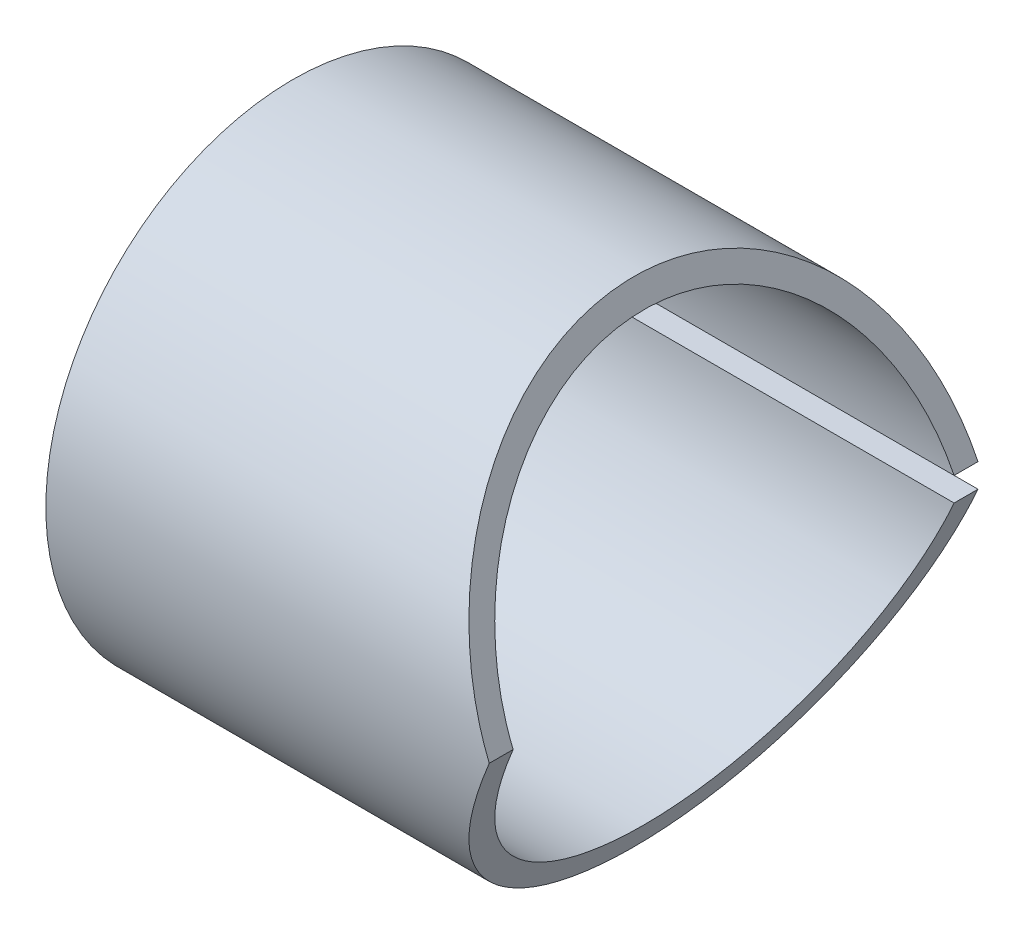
ISO-10303-21;
HEADER;
FILE_DESCRIPTION(('STEP AP214'),'2;1');
FILE_NAME('part.step','',(''),(''),'','','');
FILE_SCHEMA(('AUTOMOTIVE_DESIGN { 1 0 10303 214 1 1 1 1 }'));
ENDSEC;
DATA;
#1=APPLICATION_CONTEXT('core data for automotive mechanical design processes');
#2=APPLICATION_PROTOCOL_DEFINITION('international standard','automotive_design',2000,#1);
#3=PRODUCT_CONTEXT('',#1,'mechanical');
#4=PRODUCT('Part','Part','',(#3));
#5=PRODUCT_RELATED_PRODUCT_CATEGORY('part','',(#4));
#6=PRODUCT_DEFINITION_FORMATION('','',#4);
#7=PRODUCT_DEFINITION_CONTEXT('part definition',#1,'design');
#8=PRODUCT_DEFINITION('design','',#6,#7);
#9=PRODUCT_DEFINITION_SHAPE('','',#8);
#10=(LENGTH_UNIT() NAMED_UNIT(*) SI_UNIT(.MILLI.,.METRE.));
#11=(NAMED_UNIT(*) PLANE_ANGLE_UNIT() SI_UNIT($,.RADIAN.));
#12=(NAMED_UNIT(*) SI_UNIT($,.STERADIAN.) SOLID_ANGLE_UNIT());
#13=UNCERTAINTY_MEASURE_WITH_UNIT(LENGTH_MEASURE(1.E-05),#10,'distance_accuracy_value','');
#14=(GEOMETRIC_REPRESENTATION_CONTEXT(3) GLOBAL_UNCERTAINTY_ASSIGNED_CONTEXT((#13)) GLOBAL_UNIT_ASSIGNED_CONTEXT((#10,
#11,#12)) REPRESENTATION_CONTEXT('',''));
#15=CARTESIAN_POINT('',(0.,0.,0.));
#16=DIRECTION('',(0.,0.,1.));
#17=DIRECTION('',(1.,0.,0.));
#18=AXIS2_PLACEMENT_3D('',#15,#16,#17);
#19=CARTESIAN_POINT('',(-36.3119482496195,3.80347689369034E-13,0.));
#20=DIRECTION('',(1.,0.,0.));
#21=DIRECTION('',(0.,0.,-1.));
#22=AXIS2_PLACEMENT_3D('',#19,#20,#21);
#23=CYLINDRICAL_SURFACE('',#22,10.3513698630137);
#24=CARTESIAN_POINT('',(-17.7282787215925,1.8569397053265E-13,0.));
#25=DIRECTION('',(0.923879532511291,0.382683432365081,0.));
#26=DIRECTION('',(0.382683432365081,-0.923879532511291,0.));
#27=AXIS2_PLACEMENT_3D('',#24,#25,#26);
#28=ELLIPSE('',#27,11.2042420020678,10.3513698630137);
#29=CARTESIAN_POINT('',(-17.9353855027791,0.500000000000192,-10.3392871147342));
#30=VERTEX_POINT('',#29);
#31=CARTESIAN_POINT('',(-17.7282787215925,1.81701733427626E-13,10.3513698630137));
#32=VERTEX_POINT('',#31);
#33=EDGE_CURVE('E89',#30,#32,#28,.T.);
#34=ORIENTED_EDGE('',*,*,#33,.F.);
#35=DIRECTION('',(1.,0.,0.));
#36=VECTOR('',#35,1.);
#37=CARTESIAN_POINT('',(-36.3119482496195,0.500000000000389,-10.3392871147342));
#38=LINE('',#37,#36);
#39=CARTESIAN_POINT('',(-36.3119482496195,0.500000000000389,-10.3392871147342));
#40=VERTEX_POINT('',#39);
#41=EDGE_CURVE('E51',#30,#40,#38,.F.);
#42=ORIENTED_EDGE('',*,*,#41,.T.);
#43=CARTESIAN_POINT('',(-36.3119482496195,3.80347689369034E-13,0.));
#44=DIRECTION('',(-1.,0.,0.));
#45=DIRECTION('',(0.,0.,1.));
#46=AXIS2_PLACEMENT_3D('',#43,#44,#45);
#47=CIRCLE('',#46,10.3513698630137);
#48=CARTESIAN_POINT('',(-36.3119482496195,-0.499999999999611,-10.3392871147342));
#49=VERTEX_POINT('',#48);
#50=EDGE_CURVE('E87',#49,#40,#47,.T.);
#51=ORIENTED_EDGE('',*,*,#50,.F.);
#52=DIRECTION('',(1.,0.,0.));
#53=VECTOR('',#52,1.);
#54=CARTESIAN_POINT('',(-36.3119482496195,-0.499999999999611,-10.3392871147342));
#55=LINE('',#54,#53);
#56=CARTESIAN_POINT('',(-17.9353855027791,-0.499999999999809,-10.3392871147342));
#57=VERTEX_POINT('',#56);
#58=EDGE_CURVE('E115',#57,#49,#55,.F.);
#59=ORIENTED_EDGE('',*,*,#58,.F.);
#60=CARTESIAN_POINT('',(-17.7282787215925,1.8569397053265E-13,0.));
#61=DIRECTION('',(0.923879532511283,-0.3826834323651,0.));
#62=DIRECTION('',(0.3826834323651,0.923879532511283,0.));
#63=AXIS2_PLACEMENT_3D('',#60,#61,#62);
#64=ELLIPSE('',#63,11.2042420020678,10.3513698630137);
#65=EDGE_CURVE('E98',#32,#57,#64,.T.);
#66=ORIENTED_EDGE('',*,*,#65,.F.);
#67=EDGE_LOOP('',(#34,#42,#51,#59,#66));
#68=FACE_BOUND('',#67,.T.);
#69=ADVANCED_FACE('F30',(#68),#23,.T.);
#70=CARTESIAN_POINT('',(-22.0159565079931,-10.3513698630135,-10.3513698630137));
#71=DIRECTION('',(0.923879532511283,-0.3826834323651,0.));
#72=DIRECTION('',(0.3826834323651,0.923879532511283,0.));
#73=AXIS2_PLACEMENT_3D('',#70,#71,#72);
#74=PLANE('',#73);
#75=ORIENTED_EDGE('',*,*,#65,.T.);
#76=DIRECTION('',(0.,0.,1.));
#77=VECTOR('',#76,1.);
#78=CARTESIAN_POINT('',(-17.9353855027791,-0.499999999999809,-10.3513698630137));
#79=LINE('',#78,#77);
#80=CARTESIAN_POINT('',(-17.9353855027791,-0.499999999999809,-9.33799327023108));
#81=VERTEX_POINT('',#80);
#82=EDGE_CURVE('E11',#57,#81,#79,.T.);
#83=ORIENTED_EDGE('',*,*,#82,.T.);
#84=CARTESIAN_POINT('',(-17.7282787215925,1.8569397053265E-13,0.));
#85=DIRECTION('',(0.923879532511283,-0.3826834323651,0.));
#86=DIRECTION('',(0.3826834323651,0.923879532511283,0.));
#87=AXIS2_PLACEMENT_3D('',#84,#85,#86);
#88=ELLIPSE('',#87,10.1218498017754,9.3513698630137);
#89=CARTESIAN_POINT('',(-17.7282787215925,1.81701733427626E-13,9.35136986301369));
#90=VERTEX_POINT('',#89);
#91=EDGE_CURVE('E96',#90,#81,#88,.T.);
#92=ORIENTED_EDGE('',*,*,#91,.F.);
#93=DIRECTION('',(0.,0.,1.));
#94=VECTOR('',#93,1.);
#95=CARTESIAN_POINT('',(-17.7282787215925,1.81701733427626E-13,-10.3513698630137));
#96=LINE('',#95,#94);
#97=EDGE_CURVE('E111',#90,#32,#96,.T.);
#98=ORIENTED_EDGE('',*,*,#97,.T.);
#99=EDGE_LOOP('',(#75,#83,#92,#98));
#100=FACE_BOUND('',#99,.T.);
#101=ADVANCED_FACE('F117',(#100),#74,.T.);
#102=CARTESIAN_POINT('',(-36.3119482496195,3.80347689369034E-13,0.));
#103=DIRECTION('',(1.,0.,0.));
#104=DIRECTION('',(0.,0.,-1.));
#105=AXIS2_PLACEMENT_3D('',#102,#103,#104);
#106=CYLINDRICAL_SURFACE('',#105,9.3513698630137);
#107=DIRECTION('',(1.,0.,0.));
#108=VECTOR('',#107,1.);
#109=CARTESIAN_POINT('',(-36.3119482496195,0.500000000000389,-9.33799327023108));
#110=LINE('',#109,#108);
#111=CARTESIAN_POINT('',(-17.9353855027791,0.500000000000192,-9.33799327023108));
#112=VERTEX_POINT('',#111);
#113=CARTESIAN_POINT('',(-36.3119482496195,0.500000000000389,-9.33799327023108));
#114=VERTEX_POINT('',#113);
#115=EDGE_CURVE('E76',#112,#114,#110,.F.);
#116=ORIENTED_EDGE('',*,*,#115,.F.);
#117=CARTESIAN_POINT('',(-17.7282787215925,1.8569397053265E-13,0.));
#118=DIRECTION('',(0.923879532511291,0.382683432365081,0.));
#119=DIRECTION('',(0.382683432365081,-0.923879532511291,0.));
#120=AXIS2_PLACEMENT_3D('',#117,#118,#119);
#121=ELLIPSE('',#120,10.1218498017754,9.3513698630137);
#122=EDGE_CURVE('E93',#112,#90,#121,.T.);
#123=ORIENTED_EDGE('',*,*,#122,.T.);
#124=ORIENTED_EDGE('',*,*,#91,.T.);
#125=DIRECTION('',(1.,0.,0.));
#126=VECTOR('',#125,1.);
#127=CARTESIAN_POINT('',(-36.3119482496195,-0.499999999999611,-9.33799327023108));
#128=LINE('',#127,#126);
#129=CARTESIAN_POINT('',(-36.3119482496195,-0.499999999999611,-9.33799327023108));
#130=VERTEX_POINT('',#129);
#131=EDGE_CURVE('E44',#81,#130,#128,.F.);
#132=ORIENTED_EDGE('',*,*,#131,.T.);
#133=CARTESIAN_POINT('',(-36.3119482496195,3.80347689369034E-13,0.));
#134=DIRECTION('',(-1.,0.,0.));
#135=DIRECTION('',(0.,1.,0.));
#136=AXIS2_PLACEMENT_3D('',#133,#134,#135);
#137=CIRCLE('',#136,9.3513698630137);
#138=EDGE_CURVE('E94',#130,#114,#137,.T.);
#139=ORIENTED_EDGE('',*,*,#138,.T.);
#140=EDGE_LOOP('',(#116,#123,#124,#132,#139));
#141=FACE_BOUND('',#140,.T.);
#142=ADVANCED_FACE('F106',(#141),#106,.F.);
#143=CARTESIAN_POINT('',(-36.3119482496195,3.80347689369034E-13,0.));
#144=DIRECTION('',(-1.,0.,0.));
#145=DIRECTION('',(0.,0.,1.));
#146=AXIS2_PLACEMENT_3D('',#143,#144,#145);
#147=PLANE('',#146);
#148=DIRECTION('',(0.,0.,1.));
#149=VECTOR('',#148,1.);
#150=CARTESIAN_POINT('',(-36.3119482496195,0.500000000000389,-10.3513698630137));
#151=LINE('',#150,#149);
#152=EDGE_CURVE('E73',#40,#114,#151,.T.);
#153=ORIENTED_EDGE('',*,*,#152,.T.);
#154=ORIENTED_EDGE('',*,*,#138,.F.);
#155=DIRECTION('',(0.,0.,1.));
#156=VECTOR('',#155,1.);
#157=CARTESIAN_POINT('',(-36.3119482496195,-0.499999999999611,-10.3513698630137));
#158=LINE('',#157,#156);
#159=EDGE_CURVE('E81',#49,#130,#158,.T.);
#160=ORIENTED_EDGE('',*,*,#159,.F.);
#161=ORIENTED_EDGE('',*,*,#50,.T.);
#162=EDGE_LOOP('',(#153,#154,#160,#161));
#163=FACE_BOUND('',#162,.T.);
#164=ADVANCED_FACE('F92',(#163),#147,.T.);
#165=CARTESIAN_POINT('',(-17.7282787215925,1.81701733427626E-13,-10.3513698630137));
#166=DIRECTION('',(0.923879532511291,0.382683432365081,0.));
#167=DIRECTION('',(-0.382683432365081,0.923879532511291,0.));
#168=AXIS2_PLACEMENT_3D('',#165,#166,#167);
#169=PLANE('',#168);
#170=DIRECTION('',(0.,0.,1.));
#171=VECTOR('',#170,1.);
#172=CARTESIAN_POINT('',(-17.9353855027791,0.500000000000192,-10.3513698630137));
#173=LINE('',#172,#171);
#174=EDGE_CURVE('E37',#30,#112,#173,.T.);
#175=ORIENTED_EDGE('',*,*,#174,.F.);
#176=ORIENTED_EDGE('',*,*,#33,.T.);
#177=ORIENTED_EDGE('',*,*,#97,.F.);
#178=ORIENTED_EDGE('',*,*,#122,.F.);
#179=EDGE_LOOP('',(#175,#176,#177,#178));
#180=FACE_BOUND('',#179,.T.);
#181=ADVANCED_FACE('F109',(#180),#169,.T.);
#182=CARTESIAN_POINT('',(0.,0.5,-10.3513698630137));
#183=DIRECTION('',(0.,1.,0.));
#184=DIRECTION('',(-1.,0.,0.));
#185=AXIS2_PLACEMENT_3D('',#182,#183,#184);
#186=PLANE('',#185);
#187=ORIENTED_EDGE('',*,*,#174,.T.);
#188=ORIENTED_EDGE('',*,*,#115,.T.);
#189=ORIENTED_EDGE('',*,*,#152,.F.);
#190=ORIENTED_EDGE('',*,*,#41,.F.);
#191=EDGE_LOOP('',(#187,#188,#189,#190));
#192=FACE_BOUND('',#191,.T.);
#193=ADVANCED_FACE('F74',(#192),#186,.F.);
#194=CARTESIAN_POINT('',(0.,-0.5,-10.3513698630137));
#195=DIRECTION('',(0.,1.,0.));
#196=DIRECTION('',(-1.,0.,0.));
#197=AXIS2_PLACEMENT_3D('',#194,#195,#196);
#198=PLANE('',#197);
#199=ORIENTED_EDGE('',*,*,#58,.T.);
#200=ORIENTED_EDGE('',*,*,#159,.T.);
#201=ORIENTED_EDGE('',*,*,#131,.F.);
#202=ORIENTED_EDGE('',*,*,#82,.F.);
#203=EDGE_LOOP('',(#199,#200,#201,#202));
#204=FACE_BOUND('',#203,.T.);
#205=ADVANCED_FACE('F121',(#204),#198,.T.);
#206=CLOSED_SHELL('',(#69,#101,#142,#164,#181,#193,#205));
#207=MANIFOLD_SOLID_BREP('B2',#206);
#208=ADVANCED_BREP_SHAPE_REPRESENTATION('',(#18,#207),#14);
#209=SHAPE_DEFINITION_REPRESENTATION(#9,#208);
ENDSEC;
END-ISO-10303-21;
